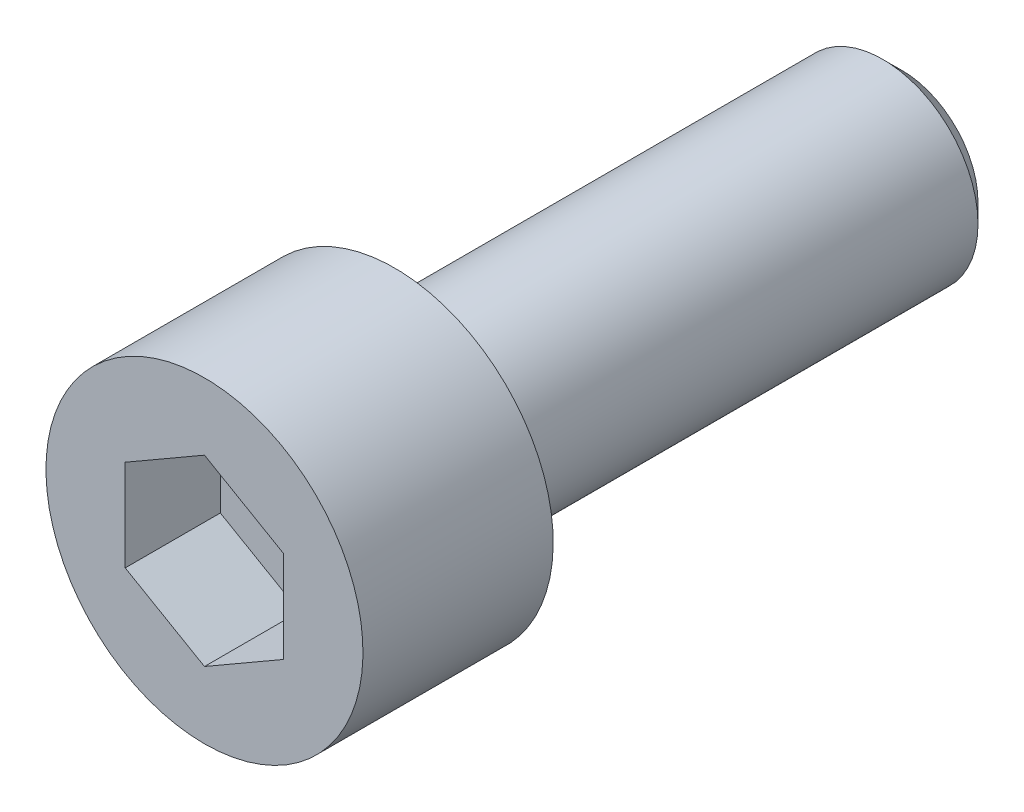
ISO-10303-21;
HEADER;
FILE_DESCRIPTION(('STEP AP214'),'2;1');
FILE_NAME('part.step','',(''),(''),'','','');
FILE_SCHEMA(('AUTOMOTIVE_DESIGN { 1 0 10303 214 1 1 1 1 }'));
ENDSEC;
DATA;
#1=APPLICATION_CONTEXT('core data for automotive mechanical design processes');
#2=APPLICATION_PROTOCOL_DEFINITION('international standard','automotive_design',2000,#1);
#3=PRODUCT_CONTEXT('',#1,'mechanical');
#4=PRODUCT('Part','Part','',(#3));
#5=PRODUCT_RELATED_PRODUCT_CATEGORY('part','',(#4));
#6=PRODUCT_DEFINITION_FORMATION('','',#4);
#7=PRODUCT_DEFINITION_CONTEXT('part definition',#1,'design');
#8=PRODUCT_DEFINITION('design','',#6,#7);
#9=PRODUCT_DEFINITION_SHAPE('','',#8);
#10=(LENGTH_UNIT() NAMED_UNIT(*) SI_UNIT(.MILLI.,.METRE.));
#11=(NAMED_UNIT(*) PLANE_ANGLE_UNIT() SI_UNIT($,.RADIAN.));
#12=(NAMED_UNIT(*) SI_UNIT($,.STERADIAN.) SOLID_ANGLE_UNIT());
#13=UNCERTAINTY_MEASURE_WITH_UNIT(LENGTH_MEASURE(1.E-05),#10,'distance_accuracy_value','');
#14=(GEOMETRIC_REPRESENTATION_CONTEXT(3) GLOBAL_UNCERTAINTY_ASSIGNED_CONTEXT((#13)) GLOBAL_UNIT_ASSIGNED_CONTEXT((#10,
#11,#12)) REPRESENTATION_CONTEXT('',''));
#15=CARTESIAN_POINT('',(0.,0.,0.));
#16=DIRECTION('',(0.,0.,1.));
#17=DIRECTION('',(1.,0.,0.));
#18=AXIS2_PLACEMENT_3D('',#15,#16,#17);
#19=CARTESIAN_POINT('',(2.50000000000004,4.33012701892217,0.));
#20=DIRECTION('',(0.,0.,1.));
#21=DIRECTION('',(0.866025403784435,-0.500000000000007,0.));
#22=AXIS2_PLACEMENT_3D('',#19,#20,#21);
#23=PLANE('',#22);
#24=CARTESIAN_POINT('',(0.,0.,0.));
#25=DIRECTION('',(0.,0.,-1.));
#26=DIRECTION('',(-0.866025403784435,0.500000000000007,0.));
#27=AXIS2_PLACEMENT_3D('',#24,#25,#26);
#28=CIRCLE('',#27,5.);
#29=CARTESIAN_POINT('',(-4.33012701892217,2.50000000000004,0.));
#30=VERTEX_POINT('',#29);
#31=EDGE_CURVE('E117',#30,#30,#28,.T.);
#32=ORIENTED_EDGE('',*,*,#31,.T.);
#33=EDGE_LOOP('',(#32));
#34=FACE_BOUND('',#33,.T.);
#35=CARTESIAN_POINT('',(0.,0.,0.));
#36=DIRECTION('',(0.,0.,1.));
#37=DIRECTION('',(1.,0.,0.));
#38=AXIS2_PLACEMENT_3D('',#35,#36,#37);
#39=CIRCLE('',#38,3.);
#40=CARTESIAN_POINT('',(3.,0.,0.));
#41=VERTEX_POINT('',#40);
#42=EDGE_CURVE('E129',#41,#41,#39,.F.);
#43=ORIENTED_EDGE('',*,*,#42,.F.);
#44=EDGE_LOOP('',(#43));
#45=FACE_BOUND('',#44,.T.);
#46=ADVANCED_FACE('F14',(#34,#45),#23,.F.);
#47=CARTESIAN_POINT('',(0.,0.,6.));
#48=DIRECTION('',(0.,0.,-1.));
#49=DIRECTION('',(-0.866025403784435,0.500000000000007,0.));
#50=AXIS2_PLACEMENT_3D('',#47,#48,#49);
#51=PLANE('',#50);
#52=DIRECTION('',(0.,1.,0.));
#53=VECTOR('',#52,1.);
#54=CARTESIAN_POINT('',(2.5,1.44337567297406,6.));
#55=LINE('',#54,#53);
#56=CARTESIAN_POINT('',(2.5,-1.44337567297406,6.));
#57=VERTEX_POINT('',#56);
#58=CARTESIAN_POINT('',(2.5,1.44337567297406,6.));
#59=VERTEX_POINT('',#58);
#60=EDGE_CURVE('E83',#57,#59,#55,.T.);
#61=ORIENTED_EDGE('',*,*,#60,.F.);
#62=DIRECTION('',(0.866025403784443,0.499999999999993,0.));
#63=VECTOR('',#62,1.);
#64=CARTESIAN_POINT('',(0.,-2.88675134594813,6.));
#65=LINE('',#64,#63);
#66=CARTESIAN_POINT('',(0.,-2.88675134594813,6.));
#67=VERTEX_POINT('',#66);
#68=EDGE_CURVE('E29',#67,#57,#65,.T.);
#69=ORIENTED_EDGE('',*,*,#68,.F.);
#70=DIRECTION('',(0.866025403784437,-0.5,0.));
#71=VECTOR('',#70,1.);
#72=CARTESIAN_POINT('',(-2.5,-1.44337567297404,6.));
#73=LINE('',#72,#71);
#74=CARTESIAN_POINT('',(-2.5,-1.44337567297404,6.));
#75=VERTEX_POINT('',#74);
#76=EDGE_CURVE('E99',#75,#67,#73,.T.);
#77=ORIENTED_EDGE('',*,*,#76,.F.);
#78=DIRECTION('',(0.,-1.,0.));
#79=VECTOR('',#78,1.);
#80=CARTESIAN_POINT('',(-2.5,-1.44337567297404,6.));
#81=LINE('',#80,#79);
#82=CARTESIAN_POINT('',(-2.5,1.4433756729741,6.));
#83=VERTEX_POINT('',#82);
#84=EDGE_CURVE('E93',#83,#75,#81,.T.);
#85=ORIENTED_EDGE('',*,*,#84,.F.);
#86=DIRECTION('',(-0.866025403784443,-0.499999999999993,0.));
#87=VECTOR('',#86,1.);
#88=CARTESIAN_POINT('',(0.,2.88675134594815,6.));
#89=LINE('',#88,#87);
#90=CARTESIAN_POINT('',(0.,2.88675134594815,6.));
#91=VERTEX_POINT('',#90);
#92=EDGE_CURVE('E91',#91,#83,#89,.T.);
#93=ORIENTED_EDGE('',*,*,#92,.F.);
#94=DIRECTION('',(-0.866025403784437,0.5,0.));
#95=VECTOR('',#94,1.);
#96=CARTESIAN_POINT('',(0.,2.88675134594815,6.));
#97=LINE('',#96,#95);
#98=EDGE_CURVE('E72',#59,#91,#97,.T.);
#99=ORIENTED_EDGE('',*,*,#98,.F.);
#100=EDGE_LOOP('',(#61,#69,#77,#85,#93,#99));
#101=FACE_BOUND('',#100,.T.);
#102=CARTESIAN_POINT('',(0.,0.,6.));
#103=DIRECTION('',(0.,0.,-1.));
#104=DIRECTION('',(-0.866025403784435,0.500000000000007,0.));
#105=AXIS2_PLACEMENT_3D('',#102,#103,#104);
#106=CIRCLE('',#105,5.);
#107=CARTESIAN_POINT('',(-4.33012701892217,2.50000000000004,6.));
#108=VERTEX_POINT('',#107);
#109=EDGE_CURVE('E126',#108,#108,#106,.T.);
#110=ORIENTED_EDGE('',*,*,#109,.F.);
#111=EDGE_LOOP('',(#110));
#112=FACE_BOUND('',#111,.T.);
#113=ADVANCED_FACE('F87',(#101,#112),#51,.F.);
#114=CARTESIAN_POINT('',(0.,0.,0.));
#115=DIRECTION('',(0.,0.,-1.));
#116=DIRECTION('',(-0.866025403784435,0.500000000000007,0.));
#117=AXIS2_PLACEMENT_3D('',#114,#115,#116);
#118=CYLINDRICAL_SURFACE('',#117,5.);
#119=ORIENTED_EDGE('',*,*,#31,.F.);
#120=EDGE_LOOP('',(#119));
#121=FACE_BOUND('',#120,.T.);
#122=ORIENTED_EDGE('',*,*,#109,.T.);
#123=EDGE_LOOP('',(#122));
#124=FACE_BOUND('',#123,.T.);
#125=ADVANCED_FACE('F155',(#121,#124),#118,.T.);
#126=CARTESIAN_POINT('',(0.,-2.88675134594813,3.));
#127=DIRECTION('',(0.499999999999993,-0.866025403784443,0.));
#128=DIRECTION('',(0.866025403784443,0.499999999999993,0.));
#129=AXIS2_PLACEMENT_3D('',#126,#127,#128);
#130=PLANE('',#129);
#131=ORIENTED_EDGE('',*,*,#68,.T.);
#132=DIRECTION('',(0.,0.,1.));
#133=VECTOR('',#132,1.);
#134=CARTESIAN_POINT('',(2.5,-1.44337567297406,3.));
#135=LINE('',#134,#133);
#136=CARTESIAN_POINT('',(2.5,-1.44337567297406,3.));
#137=VERTEX_POINT('',#136);
#138=EDGE_CURVE('E80',#137,#57,#135,.T.);
#139=ORIENTED_EDGE('',*,*,#138,.F.);
#140=DIRECTION('',(0.866025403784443,0.499999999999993,0.));
#141=VECTOR('',#140,1.);
#142=CARTESIAN_POINT('',(0.,-2.88675134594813,3.));
#143=LINE('',#142,#141);
#144=CARTESIAN_POINT('',(0.,-2.88675134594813,3.));
#145=VERTEX_POINT('',#144);
#146=EDGE_CURVE('E101',#145,#137,#143,.T.);
#147=ORIENTED_EDGE('',*,*,#146,.F.);
#148=DIRECTION('',(0.,0.,1.));
#149=VECTOR('',#148,1.);
#150=CARTESIAN_POINT('',(0.,-2.88675134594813,3.));
#151=LINE('',#150,#149);
#152=EDGE_CURVE('E36',#145,#67,#151,.T.);
#153=ORIENTED_EDGE('',*,*,#152,.T.);
#154=EDGE_LOOP('',(#131,#139,#147,#153));
#155=FACE_BOUND('',#154,.T.);
#156=ADVANCED_FACE('F160',(#155),#130,.F.);
#157=CARTESIAN_POINT('',(-2.5,-1.44337567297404,3.));
#158=DIRECTION('',(-0.5,-0.866025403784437,0.));
#159=DIRECTION('',(0.866025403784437,-0.5,0.));
#160=AXIS2_PLACEMENT_3D('',#157,#158,#159);
#161=PLANE('',#160);
#162=ORIENTED_EDGE('',*,*,#76,.T.);
#163=ORIENTED_EDGE('',*,*,#152,.F.);
#164=DIRECTION('',(0.866025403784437,-0.5,0.));
#165=VECTOR('',#164,1.);
#166=CARTESIAN_POINT('',(-2.5,-1.44337567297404,3.));
#167=LINE('',#166,#165);
#168=CARTESIAN_POINT('',(-2.5,-1.44337567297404,3.));
#169=VERTEX_POINT('',#168);
#170=EDGE_CURVE('E113',#169,#145,#167,.T.);
#171=ORIENTED_EDGE('',*,*,#170,.F.);
#172=DIRECTION('',(0.,0.,1.));
#173=VECTOR('',#172,1.);
#174=CARTESIAN_POINT('',(-2.5,-1.44337567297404,3.));
#175=LINE('',#174,#173);
#176=EDGE_CURVE('E118',#169,#75,#175,.T.);
#177=ORIENTED_EDGE('',*,*,#176,.T.);
#178=EDGE_LOOP('',(#162,#163,#171,#177));
#179=FACE_BOUND('',#178,.T.);
#180=ADVANCED_FACE('F166',(#179),#161,.F.);
#181=CARTESIAN_POINT('',(-2.5,-1.44337567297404,3.));
#182=DIRECTION('',(-1.,0.,0.));
#183=DIRECTION('',(0.,-1.,0.));
#184=AXIS2_PLACEMENT_3D('',#181,#182,#183);
#185=PLANE('',#184);
#186=ORIENTED_EDGE('',*,*,#84,.T.);
#187=ORIENTED_EDGE('',*,*,#176,.F.);
#188=DIRECTION('',(0.,-1.,0.));
#189=VECTOR('',#188,1.);
#190=CARTESIAN_POINT('',(-2.5,-1.44337567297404,3.));
#191=LINE('',#190,#189);
#192=CARTESIAN_POINT('',(-2.5,1.4433756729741,3.));
#193=VERTEX_POINT('',#192);
#194=EDGE_CURVE('E110',#193,#169,#191,.T.);
#195=ORIENTED_EDGE('',*,*,#194,.F.);
#196=DIRECTION('',(0.,0.,1.));
#197=VECTOR('',#196,1.);
#198=CARTESIAN_POINT('',(-2.5,1.4433756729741,3.));
#199=LINE('',#198,#197);
#200=EDGE_CURVE('E120',#193,#83,#199,.T.);
#201=ORIENTED_EDGE('',*,*,#200,.T.);
#202=EDGE_LOOP('',(#186,#187,#195,#201));
#203=FACE_BOUND('',#202,.T.);
#204=ADVANCED_FACE('F174',(#203),#185,.F.);
#205=CARTESIAN_POINT('',(0.,2.88675134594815,3.));
#206=DIRECTION('',(-0.499999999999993,0.866025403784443,0.));
#207=DIRECTION('',(-0.866025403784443,-0.499999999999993,0.));
#208=AXIS2_PLACEMENT_3D('',#205,#206,#207);
#209=PLANE('',#208);
#210=ORIENTED_EDGE('',*,*,#92,.T.);
#211=ORIENTED_EDGE('',*,*,#200,.F.);
#212=DIRECTION('',(-0.866025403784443,-0.499999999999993,0.));
#213=VECTOR('',#212,1.);
#214=CARTESIAN_POINT('',(0.,2.88675134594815,3.));
#215=LINE('',#214,#213);
#216=CARTESIAN_POINT('',(0.,2.88675134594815,3.));
#217=VERTEX_POINT('',#216);
#218=EDGE_CURVE('E107',#217,#193,#215,.T.);
#219=ORIENTED_EDGE('',*,*,#218,.F.);
#220=DIRECTION('',(0.,0.,1.));
#221=VECTOR('',#220,1.);
#222=CARTESIAN_POINT('',(0.,2.88675134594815,3.));
#223=LINE('',#222,#221);
#224=EDGE_CURVE('E79',#217,#91,#223,.T.);
#225=ORIENTED_EDGE('',*,*,#224,.T.);
#226=EDGE_LOOP('',(#210,#211,#219,#225));
#227=FACE_BOUND('',#226,.T.);
#228=ADVANCED_FACE('F182',(#227),#209,.F.);
#229=CARTESIAN_POINT('',(0.,2.88675134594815,3.));
#230=DIRECTION('',(0.5,0.866025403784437,0.));
#231=DIRECTION('',(-0.866025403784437,0.5,0.));
#232=AXIS2_PLACEMENT_3D('',#229,#230,#231);
#233=PLANE('',#232);
#234=ORIENTED_EDGE('',*,*,#98,.T.);
#235=ORIENTED_EDGE('',*,*,#224,.F.);
#236=DIRECTION('',(-0.866025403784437,0.5,0.));
#237=VECTOR('',#236,1.);
#238=CARTESIAN_POINT('',(0.,2.88675134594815,3.));
#239=LINE('',#238,#237);
#240=CARTESIAN_POINT('',(2.5,1.44337567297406,3.));
#241=VERTEX_POINT('',#240);
#242=EDGE_CURVE('E75',#241,#217,#239,.T.);
#243=ORIENTED_EDGE('',*,*,#242,.F.);
#244=DIRECTION('',(0.,0.,1.));
#245=VECTOR('',#244,1.);
#246=CARTESIAN_POINT('',(2.5,1.44337567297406,3.));
#247=LINE('',#246,#245);
#248=EDGE_CURVE('E68',#241,#59,#247,.T.);
#249=ORIENTED_EDGE('',*,*,#248,.T.);
#250=EDGE_LOOP('',(#234,#235,#243,#249));
#251=FACE_BOUND('',#250,.T.);
#252=ADVANCED_FACE('F70',(#251),#233,.F.);
#253=CARTESIAN_POINT('',(2.5,1.44337567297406,3.));
#254=DIRECTION('',(1.,0.,0.));
#255=DIRECTION('',(0.,1.,0.));
#256=AXIS2_PLACEMENT_3D('',#253,#254,#255);
#257=PLANE('',#256);
#258=ORIENTED_EDGE('',*,*,#60,.T.);
#259=ORIENTED_EDGE('',*,*,#248,.F.);
#260=DIRECTION('',(0.,1.,0.));
#261=VECTOR('',#260,1.);
#262=CARTESIAN_POINT('',(2.5,1.44337567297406,3.));
#263=LINE('',#262,#261);
#264=EDGE_CURVE('E104',#137,#241,#263,.T.);
#265=ORIENTED_EDGE('',*,*,#264,.F.);
#266=ORIENTED_EDGE('',*,*,#138,.T.);
#267=EDGE_LOOP('',(#258,#259,#265,#266));
#268=FACE_BOUND('',#267,.T.);
#269=ADVANCED_FACE('F84',(#268),#257,.F.);
#270=CARTESIAN_POINT('',(2.5,-1.44337567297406,3.));
#271=DIRECTION('',(0.,0.,-1.));
#272=DIRECTION('',(-0.866025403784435,0.500000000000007,0.));
#273=AXIS2_PLACEMENT_3D('',#270,#271,#272);
#274=PLANE('',#273);
#275=ORIENTED_EDGE('',*,*,#146,.T.);
#276=ORIENTED_EDGE('',*,*,#264,.T.);
#277=ORIENTED_EDGE('',*,*,#242,.T.);
#278=ORIENTED_EDGE('',*,*,#218,.T.);
#279=ORIENTED_EDGE('',*,*,#194,.T.);
#280=ORIENTED_EDGE('',*,*,#170,.T.);
#281=EDGE_LOOP('',(#275,#276,#277,#278,#279,#280));
#282=FACE_BOUND('',#281,.T.);
#283=ADVANCED_FACE('F179',(#282),#274,.F.);
#284=CARTESIAN_POINT('',(0.,0.,-24.4852813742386));
#285=DIRECTION('',(0.,0.,1.));
#286=DIRECTION('',(1.,0.,0.));
#287=AXIS2_PLACEMENT_3D('',#284,#285,#286);
#288=CYLINDRICAL_SURFACE('',#287,3.);
#289=CARTESIAN_POINT('',(0.,0.,-15.4));
#290=DIRECTION('',(0.,0.,1.));
#291=DIRECTION('',(1.,0.,0.));
#292=AXIS2_PLACEMENT_3D('',#289,#290,#291);
#293=CIRCLE('',#292,3.);
#294=CARTESIAN_POINT('',(3.,0.,-15.4));
#295=VERTEX_POINT('',#294);
#296=EDGE_CURVE('E22',#295,#295,#293,.T.);
#297=ORIENTED_EDGE('',*,*,#296,.T.);
#298=EDGE_LOOP('',(#297));
#299=FACE_BOUND('',#298,.T.);
#300=ORIENTED_EDGE('',*,*,#42,.T.);
#301=EDGE_LOOP('',(#300));
#302=FACE_BOUND('',#301,.T.);
#303=ADVANCED_FACE('F134',(#299,#302),#288,.T.);
#304=CARTESIAN_POINT('',(1.5,2.5980762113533,-16.));
#305=DIRECTION('',(0.,0.,1.));
#306=DIRECTION('',(0.866025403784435,-0.500000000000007,0.));
#307=AXIS2_PLACEMENT_3D('',#304,#305,#306);
#308=PLANE('',#307);
#309=CARTESIAN_POINT('',(0.,0.,-16.));
#310=DIRECTION('',(0.,0.,1.));
#311=DIRECTION('',(1.,0.,0.));
#312=AXIS2_PLACEMENT_3D('',#309,#310,#311);
#313=CIRCLE('',#312,2.4);
#314=CARTESIAN_POINT('',(2.4,0.,-16.));
#315=VERTEX_POINT('',#314);
#316=EDGE_CURVE('E9',#315,#315,#313,.F.);
#317=ORIENTED_EDGE('',*,*,#316,.T.);
#318=EDGE_LOOP('',(#317));
#319=FACE_BOUND('',#318,.T.);
#320=ADVANCED_FACE('F138',(#319),#308,.F.);
#321=CARTESIAN_POINT('',(0.,0.,-15.4));
#322=DIRECTION('',(0.,0.,1.));
#323=DIRECTION('',(1.,0.,0.));
#324=AXIS2_PLACEMENT_3D('',#321,#322,#323);
#325=CONICAL_SURFACE('',#324,3.,0.785398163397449);
#326=ORIENTED_EDGE('',*,*,#316,.F.);
#327=EDGE_LOOP('',(#326));
#328=FACE_BOUND('',#327,.T.);
#329=ORIENTED_EDGE('',*,*,#296,.F.);
#330=EDGE_LOOP('',(#329));
#331=FACE_BOUND('',#330,.T.);
#332=ADVANCED_FACE('F16',(#328,#331),#325,.T.);
#333=CLOSED_SHELL('',(#46,#113,#125,#156,#180,#204,#228,#252,#269,#283,#303,#320,#332));
#334=MANIFOLD_SOLID_BREP('B1',#333);
#335=ADVANCED_BREP_SHAPE_REPRESENTATION('',(#18,#334),#14);
#336=SHAPE_DEFINITION_REPRESENTATION(#9,#335);
ENDSEC;
END-ISO-10303-21;
